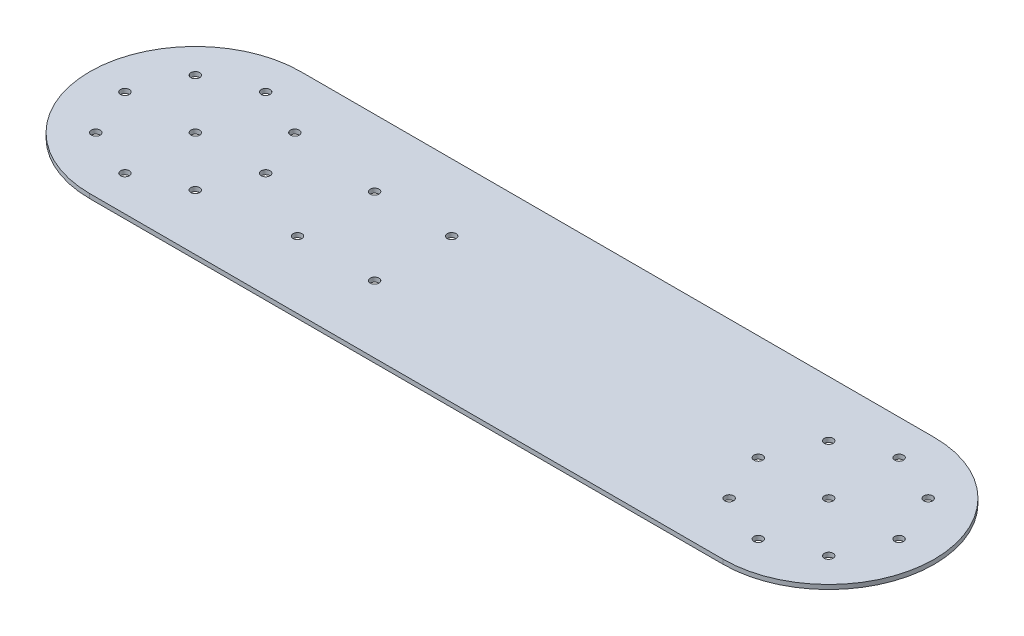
ISO-10303-21;
HEADER;
FILE_DESCRIPTION(('STEP AP214'),'2;1');
FILE_NAME('part.step','',(''),(''),'','','');
FILE_SCHEMA(('AUTOMOTIVE_DESIGN { 1 0 10303 214 1 1 1 1 }'));
ENDSEC;
DATA;
#1=APPLICATION_CONTEXT('core data for automotive mechanical design processes');
#2=APPLICATION_PROTOCOL_DEFINITION('international standard','automotive_design',2000,#1);
#3=PRODUCT_CONTEXT('',#1,'mechanical');
#4=PRODUCT('Part','Part','',(#3));
#5=PRODUCT_RELATED_PRODUCT_CATEGORY('part','',(#4));
#6=PRODUCT_DEFINITION_FORMATION('','',#4);
#7=PRODUCT_DEFINITION_CONTEXT('part definition',#1,'design');
#8=PRODUCT_DEFINITION('design','',#6,#7);
#9=PRODUCT_DEFINITION_SHAPE('','',#8);
#10=(LENGTH_UNIT() NAMED_UNIT(*) SI_UNIT(.MILLI.,.METRE.));
#11=(NAMED_UNIT(*) PLANE_ANGLE_UNIT() SI_UNIT($,.RADIAN.));
#12=(NAMED_UNIT(*) SI_UNIT($,.STERADIAN.) SOLID_ANGLE_UNIT());
#13=UNCERTAINTY_MEASURE_WITH_UNIT(LENGTH_MEASURE(1.E-05),#10,'distance_accuracy_value','');
#14=(GEOMETRIC_REPRESENTATION_CONTEXT(3) GLOBAL_UNCERTAINTY_ASSIGNED_CONTEXT((#13)) GLOBAL_UNIT_ASSIGNED_CONTEXT((#10,
#11,#12)) REPRESENTATION_CONTEXT('',''));
#15=CARTESIAN_POINT('',(0.,0.,0.));
#16=DIRECTION('',(0.,0.,1.));
#17=DIRECTION('',(1.,0.,0.));
#18=AXIS2_PLACEMENT_3D('',#15,#16,#17);
#19=CARTESIAN_POINT('',(228.6,3.175,0.));
#20=DIRECTION('',(0.,-1.,0.));
#21=DIRECTION('',(0.,0.,-1.));
#22=AXIS2_PLACEMENT_3D('',#19,#20,#21);
#23=PLANE('',#22);
#24=CARTESIAN_POINT('',(228.6,3.175,0.));
#25=DIRECTION('',(0.,-1.,0.));
#26=DIRECTION('',(0.,0.,1.));
#27=AXIS2_PLACEMENT_3D('',#24,#25,#26);
#28=CIRCLE('',#27,3.17499999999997);
#29=CARTESIAN_POINT('',(228.6,3.175,3.17499999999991));
#30=VERTEX_POINT('',#29);
#31=EDGE_CURVE('E245',#30,#30,#28,.T.);
#32=ORIENTED_EDGE('',*,*,#31,.T.);
#33=EDGE_LOOP('',(#32));
#34=FACE_BOUND('',#33,.T.);
#35=CARTESIAN_POINT('',(228.6,3.175,-50.8000000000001));
#36=DIRECTION('',(0.,-1.,0.));
#37=DIRECTION('',(0.,0.,1.));
#38=AXIS2_PLACEMENT_3D('',#35,#36,#37);
#39=CIRCLE('',#38,3.17499999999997);
#40=CARTESIAN_POINT('',(228.6,3.175,-47.6250000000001));
#41=VERTEX_POINT('',#40);
#42=EDGE_CURVE('E229',#41,#41,#39,.T.);
#43=ORIENTED_EDGE('',*,*,#42,.T.);
#44=EDGE_LOOP('',(#43));
#45=FACE_BOUND('',#44,.T.);
#46=CARTESIAN_POINT('',(264.521024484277,3.175,-35.9210244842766));
#47=DIRECTION('',(0.,-1.,0.));
#48=DIRECTION('',(-0.707106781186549,0.,0.707106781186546));
#49=AXIS2_PLACEMENT_3D('',#46,#47,#48);
#50=CIRCLE('',#49,3.17499999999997);
#51=CARTESIAN_POINT('',(262.275960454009,3.175,-33.6759604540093));
#52=VERTEX_POINT('',#51);
#53=EDGE_CURVE('E286',#52,#52,#50,.T.);
#54=ORIENTED_EDGE('',*,*,#53,.T.);
#55=EDGE_LOOP('',(#54));
#56=FACE_BOUND('',#55,.T.);
#57=CARTESIAN_POINT('',(279.4,3.175,0.));
#58=DIRECTION('',(0.,-1.,0.));
#59=DIRECTION('',(-1.,0.,0.));
#60=AXIS2_PLACEMENT_3D('',#57,#58,#59);
#61=CIRCLE('',#60,3.17499999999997);
#62=CARTESIAN_POINT('',(276.225,3.175,0.));
#63=VERTEX_POINT('',#62);
#64=EDGE_CURVE('E278',#63,#63,#61,.T.);
#65=ORIENTED_EDGE('',*,*,#64,.T.);
#66=EDGE_LOOP('',(#65));
#67=FACE_BOUND('',#66,.T.);
#68=CARTESIAN_POINT('',(264.521024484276,3.175,35.9210244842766));
#69=DIRECTION('',(0.,-1.,0.));
#70=DIRECTION('',(-0.707106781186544,0.,-0.707106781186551));
#71=AXIS2_PLACEMENT_3D('',#68,#69,#70);
#72=CIRCLE('',#71,3.17499999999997);
#73=CARTESIAN_POINT('',(262.275960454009,3.175,33.6759604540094));
#74=VERTEX_POINT('',#73);
#75=EDGE_CURVE('E270',#74,#74,#72,.T.);
#76=ORIENTED_EDGE('',*,*,#75,.T.);
#77=EDGE_LOOP('',(#76));
#78=FACE_BOUND('',#77,.T.);
#79=CARTESIAN_POINT('',(228.6,3.175,50.7999999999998));
#80=DIRECTION('',(0.,-1.,0.));
#81=DIRECTION('',(0.,0.,-1.));
#82=AXIS2_PLACEMENT_3D('',#79,#80,#81);
#83=CIRCLE('',#82,3.17499999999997);
#84=CARTESIAN_POINT('',(228.6,3.175,47.6249999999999));
#85=VERTEX_POINT('',#84);
#86=EDGE_CURVE('E262',#85,#85,#83,.T.);
#87=ORIENTED_EDGE('',*,*,#86,.T.);
#88=EDGE_LOOP('',(#87));
#89=FACE_BOUND('',#88,.T.);
#90=CARTESIAN_POINT('',(192.678975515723,3.175,35.9210244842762));
#91=DIRECTION('',(0.,-1.,0.));
#92=DIRECTION('',(0.707106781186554,0.,-0.707106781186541));
#93=AXIS2_PLACEMENT_3D('',#90,#91,#92);
#94=CIRCLE('',#93,3.17499999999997);
#95=CARTESIAN_POINT('',(194.92403954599,3.175,33.6759604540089));
#96=VERTEX_POINT('',#95);
#97=EDGE_CURVE('E254',#96,#96,#94,.T.);
#98=ORIENTED_EDGE('',*,*,#97,.T.);
#99=EDGE_LOOP('',(#98));
#100=FACE_BOUND('',#99,.T.);
#101=CARTESIAN_POINT('',(177.8,3.175,-6.10622663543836E-13));
#102=DIRECTION('',(0.,-1.,0.));
#103=DIRECTION('',(1.,0.,0.));
#104=AXIS2_PLACEMENT_3D('',#101,#102,#103);
#105=CIRCLE('',#104,3.17499999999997);
#106=CARTESIAN_POINT('',(180.975,3.175,-5.77311809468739E-13));
#107=VERTEX_POINT('',#106);
#108=EDGE_CURVE('E246',#107,#107,#105,.T.);
#109=ORIENTED_EDGE('',*,*,#108,.T.);
#110=EDGE_LOOP('',(#109));
#111=FACE_BOUND('',#110,.T.);
#112=CARTESIAN_POINT('',(192.678975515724,3.175,-35.9210244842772));
#113=DIRECTION('',(0.,-1.,0.));
#114=DIRECTION('',(0.707106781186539,0.,0.707106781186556));
#115=AXIS2_PLACEMENT_3D('',#112,#113,#114);
#116=CIRCLE('',#115,3.17499999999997);
#117=CARTESIAN_POINT('',(194.924039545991,3.175,-33.6759604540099));
#118=VERTEX_POINT('',#117);
#119=EDGE_CURVE('E236',#118,#118,#116,.T.);
#120=ORIENTED_EDGE('',*,*,#119,.T.);
#121=EDGE_LOOP('',(#120));
#122=FACE_BOUND('',#121,.T.);
#123=CARTESIAN_POINT('',(-279.4,3.175,0.));
#124=DIRECTION('',(0.,1.,0.));
#125=DIRECTION('',(1.,0.,0.));
#126=AXIS2_PLACEMENT_3D('',#123,#124,#125);
#127=CIRCLE('',#126,3.17499999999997);
#128=CARTESIAN_POINT('',(-276.225,3.175,0.));
#129=VERTEX_POINT('',#128);
#130=EDGE_CURVE('E187',#129,#129,#127,.T.);
#131=ORIENTED_EDGE('',*,*,#130,.F.);
#132=EDGE_LOOP('',(#131));
#133=FACE_BOUND('',#132,.T.);
#134=CARTESIAN_POINT('',(-264.521024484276,3.175,35.9210244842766));
#135=DIRECTION('',(0.,1.,0.));
#136=DIRECTION('',(0.707106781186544,0.,-0.707106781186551));
#137=AXIS2_PLACEMENT_3D('',#134,#135,#136);
#138=CIRCLE('',#137,3.17499999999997);
#139=CARTESIAN_POINT('',(-262.275960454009,3.175,33.6759604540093));
#140=VERTEX_POINT('',#139);
#141=EDGE_CURVE('E206',#140,#140,#138,.T.);
#142=ORIENTED_EDGE('',*,*,#141,.F.);
#143=EDGE_LOOP('',(#142));
#144=FACE_BOUND('',#143,.T.);
#145=CARTESIAN_POINT('',(-228.6,3.175,50.7999999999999));
#146=DIRECTION('',(0.,1.,0.));
#147=DIRECTION('',(0.,0.,-1.));
#148=AXIS2_PLACEMENT_3D('',#145,#146,#147);
#149=CIRCLE('',#148,3.17499999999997);
#150=CARTESIAN_POINT('',(-228.6,3.175,47.6249999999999));
#151=VERTEX_POINT('',#150);
#152=EDGE_CURVE('E198',#151,#151,#149,.T.);
#153=ORIENTED_EDGE('',*,*,#152,.F.);
#154=EDGE_LOOP('',(#153));
#155=FACE_BOUND('',#154,.T.);
#156=CARTESIAN_POINT('',(-192.678975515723,3.175,35.9210244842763));
#157=DIRECTION('',(0.,1.,0.));
#158=DIRECTION('',(-0.707106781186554,0.,-0.707106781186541));
#159=AXIS2_PLACEMENT_3D('',#156,#157,#158);
#160=CIRCLE('',#159,3.17499999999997);
#161=CARTESIAN_POINT('',(-194.92403954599,3.175,33.675960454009));
#162=VERTEX_POINT('',#161);
#163=EDGE_CURVE('E188',#162,#162,#160,.T.);
#164=ORIENTED_EDGE('',*,*,#163,.F.);
#165=EDGE_LOOP('',(#164));
#166=FACE_BOUND('',#165,.T.);
#167=CARTESIAN_POINT('',(-177.8,3.175,-7.21644966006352E-13));
#168=DIRECTION('',(0.,1.,0.));
#169=DIRECTION('',(-1.,0.,0.));
#170=AXIS2_PLACEMENT_3D('',#167,#168,#169);
#171=CIRCLE('',#170,3.17499999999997);
#172=CARTESIAN_POINT('',(-180.975,3.175,-6.88334111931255E-13));
#173=VERTEX_POINT('',#172);
#174=EDGE_CURVE('E197',#173,#173,#171,.T.);
#175=ORIENTED_EDGE('',*,*,#174,.F.);
#176=EDGE_LOOP('',(#175));
#177=FACE_BOUND('',#176,.T.);
#178=CARTESIAN_POINT('',(-192.678975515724,3.175,-35.9210244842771));
#179=DIRECTION('',(0.,1.,0.));
#180=DIRECTION('',(-0.707106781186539,0.,0.707106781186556));
#181=AXIS2_PLACEMENT_3D('',#178,#179,#180);
#182=CIRCLE('',#181,3.17499999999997);
#183=CARTESIAN_POINT('',(-194.924039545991,3.175,-33.6759604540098));
#184=VERTEX_POINT('',#183);
#185=EDGE_CURVE('E220',#184,#184,#182,.T.);
#186=ORIENTED_EDGE('',*,*,#185,.F.);
#187=EDGE_LOOP('',(#186));
#188=FACE_BOUND('',#187,.T.);
#189=CARTESIAN_POINT('',(-264.521024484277,3.175,-35.9210244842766));
#190=DIRECTION('',(0.,1.,0.));
#191=DIRECTION('',(0.707106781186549,0.,0.707106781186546));
#192=AXIS2_PLACEMENT_3D('',#189,#190,#191);
#193=CIRCLE('',#192,3.17499999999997);
#194=CARTESIAN_POINT('',(-262.275960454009,3.175,-33.6759604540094));
#195=VERTEX_POINT('',#194);
#196=EDGE_CURVE('E169',#195,#195,#193,.T.);
#197=ORIENTED_EDGE('',*,*,#196,.F.);
#198=EDGE_LOOP('',(#197));
#199=FACE_BOUND('',#198,.T.);
#200=CARTESIAN_POINT('',(-228.6,3.175,-50.8000000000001));
#201=DIRECTION('',(0.,1.,0.));
#202=DIRECTION('',(0.,0.,1.));
#203=AXIS2_PLACEMENT_3D('',#200,#201,#202);
#204=CIRCLE('',#203,3.17499999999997);
#205=CARTESIAN_POINT('',(-228.6,3.175,-47.6250000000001));
#206=VERTEX_POINT('',#205);
#207=EDGE_CURVE('E173',#206,#206,#204,.T.);
#208=ORIENTED_EDGE('',*,*,#207,.F.);
#209=EDGE_LOOP('',(#208));
#210=FACE_BOUND('',#209,.T.);
#211=CARTESIAN_POINT('',(-228.6,3.175,-1.66533453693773E-13));
#212=DIRECTION('',(0.,1.,0.));
#213=DIRECTION('',(0.,0.,1.));
#214=AXIS2_PLACEMENT_3D('',#211,#212,#213);
#215=CIRCLE('',#214,3.17499999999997);
#216=CARTESIAN_POINT('',(-228.6,3.175,3.1749999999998));
#217=VERTEX_POINT('',#216);
#218=EDGE_CURVE('E164',#217,#217,#215,.T.);
#219=ORIENTED_EDGE('',*,*,#218,.F.);
#220=EDGE_LOOP('',(#219));
#221=FACE_BOUND('',#220,.T.);
#222=CARTESIAN_POINT('',(228.6,3.175,0.));
#223=DIRECTION('',(0.,1.,0.));
#224=DIRECTION('',(0.,0.,-1.));
#225=AXIS2_PLACEMENT_3D('',#222,#223,#224);
#226=CIRCLE('',#225,76.2);
#227=CARTESIAN_POINT('',(228.6,3.175,76.1999999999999));
#228=VERTEX_POINT('',#227);
#229=CARTESIAN_POINT('',(228.6,3.175,-76.2000000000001));
#230=VERTEX_POINT('',#229);
#231=EDGE_CURVE('E91',#228,#230,#226,.T.);
#232=ORIENTED_EDGE('',*,*,#231,.T.);
#233=DIRECTION('',(-1.,0.,0.));
#234=VECTOR('',#233,1.);
#235=CARTESIAN_POINT('',(-228.6,3.175,-76.2000000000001));
#236=LINE('',#235,#234);
#237=CARTESIAN_POINT('',(-228.6,3.175,-76.2000000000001));
#238=VERTEX_POINT('',#237);
#239=EDGE_CURVE('E86',#230,#238,#236,.T.);
#240=ORIENTED_EDGE('',*,*,#239,.T.);
#241=CARTESIAN_POINT('',(-228.6,3.175,-1.66533453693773E-13));
#242=DIRECTION('',(0.,1.,0.));
#243=DIRECTION('',(0.,0.,1.));
#244=AXIS2_PLACEMENT_3D('',#241,#242,#243);
#245=CIRCLE('',#244,76.2);
#246=CARTESIAN_POINT('',(-228.6,3.175,76.1999999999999));
#247=VERTEX_POINT('',#246);
#248=EDGE_CURVE('E89',#238,#247,#245,.T.);
#249=ORIENTED_EDGE('',*,*,#248,.T.);
#250=DIRECTION('',(1.,0.,0.));
#251=VECTOR('',#250,1.);
#252=CARTESIAN_POINT('',(-228.6,3.175,76.1999999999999));
#253=LINE('',#252,#251);
#254=EDGE_CURVE('E56',#247,#228,#253,.T.);
#255=ORIENTED_EDGE('',*,*,#254,.T.);
#256=EDGE_LOOP('',(#232,#240,#249,#255));
#257=FACE_BOUND('',#256,.T.);
#258=CARTESIAN_POINT('',(-127.,3.175,-27.8130000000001));
#259=DIRECTION('',(0.,1.,0.));
#260=DIRECTION('',(0.,0.,1.));
#261=AXIS2_PLACEMENT_3D('',#258,#259,#260);
#262=CIRCLE('',#261,3.175);
#263=CARTESIAN_POINT('',(-127.,3.175,-24.6380000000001));
#264=VERTEX_POINT('',#263);
#265=EDGE_CURVE('E112',#264,#264,#262,.T.);
#266=ORIENTED_EDGE('',*,*,#265,.F.);
#267=EDGE_LOOP('',(#266));
#268=FACE_BOUND('',#267,.T.);
#269=CARTESIAN_POINT('',(-127.,3.175,27.8129999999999));
#270=DIRECTION('',(0.,1.,0.));
#271=DIRECTION('',(0.,0.,1.));
#272=AXIS2_PLACEMENT_3D('',#269,#270,#271);
#273=CIRCLE('',#272,3.175);
#274=CARTESIAN_POINT('',(-127.,3.175,30.9879999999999));
#275=VERTEX_POINT('',#274);
#276=EDGE_CURVE('E136',#275,#275,#273,.T.);
#277=ORIENTED_EDGE('',*,*,#276,.F.);
#278=EDGE_LOOP('',(#277));
#279=FACE_BOUND('',#278,.T.);
#280=CARTESIAN_POINT('',(-71.3739999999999,3.175,27.8129999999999));
#281=DIRECTION('',(0.,1.,0.));
#282=DIRECTION('',(0.,0.,-1.));
#283=AXIS2_PLACEMENT_3D('',#280,#281,#282);
#284=CIRCLE('',#283,3.175);
#285=CARTESIAN_POINT('',(-71.3739999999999,3.175,24.6379999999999));
#286=VERTEX_POINT('',#285);
#287=EDGE_CURVE('E144',#286,#286,#284,.T.);
#288=ORIENTED_EDGE('',*,*,#287,.F.);
#289=EDGE_LOOP('',(#288));
#290=FACE_BOUND('',#289,.T.);
#291=CARTESIAN_POINT('',(-71.3740000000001,3.175,-27.8130000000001));
#292=DIRECTION('',(0.,1.,0.));
#293=DIRECTION('',(0.,0.,-1.));
#294=AXIS2_PLACEMENT_3D('',#291,#292,#293);
#295=CIRCLE('',#294,3.175);
#296=CARTESIAN_POINT('',(-71.3740000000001,3.175,-30.9880000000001));
#297=VERTEX_POINT('',#296);
#298=EDGE_CURVE('E152',#297,#297,#295,.T.);
#299=ORIENTED_EDGE('',*,*,#298,.F.);
#300=EDGE_LOOP('',(#299));
#301=FACE_BOUND('',#300,.T.);
#302=ADVANCED_FACE('F38',(#34,#45,#56,#67,#78,#89,#100,#111,#122,#133,#144,#155,#166,#177,#188,
#199,#210,#221,#257,#268,#279,#290,#301),#23,.F.);
#303=CARTESIAN_POINT('',(228.6,0.,0.));
#304=DIRECTION('',(0.,-1.,0.));
#305=DIRECTION('',(0.,0.,-1.));
#306=AXIS2_PLACEMENT_3D('',#303,#304,#305);
#307=PLANE('',#306);
#308=CARTESIAN_POINT('',(228.6,0.,0.));
#309=DIRECTION('',(0.,-1.,0.));
#310=DIRECTION('',(0.,0.,1.));
#311=AXIS2_PLACEMENT_3D('',#308,#309,#310);
#312=CIRCLE('',#311,3.17499999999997);
#313=CARTESIAN_POINT('',(228.6,0.,3.17499999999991));
#314=VERTEX_POINT('',#313);
#315=EDGE_CURVE('E303',#314,#314,#312,.T.);
#316=ORIENTED_EDGE('',*,*,#315,.F.);
#317=EDGE_LOOP('',(#316));
#318=FACE_BOUND('',#317,.T.);
#319=CARTESIAN_POINT('',(228.6,0.,-50.8000000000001));
#320=DIRECTION('',(0.,-1.,0.));
#321=DIRECTION('',(0.,0.,1.));
#322=AXIS2_PLACEMENT_3D('',#319,#320,#321);
#323=CIRCLE('',#322,3.17499999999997);
#324=CARTESIAN_POINT('',(228.6,0.,-47.6250000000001));
#325=VERTEX_POINT('',#324);
#326=EDGE_CURVE('E290',#325,#325,#323,.T.);
#327=ORIENTED_EDGE('',*,*,#326,.F.);
#328=EDGE_LOOP('',(#327));
#329=FACE_BOUND('',#328,.T.);
#330=CARTESIAN_POINT('',(264.521024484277,0.,-35.9210244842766));
#331=DIRECTION('',(0.,-1.,0.));
#332=DIRECTION('',(-0.707106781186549,0.,0.707106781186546));
#333=AXIS2_PLACEMENT_3D('',#330,#331,#332);
#334=CIRCLE('',#333,3.17499999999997);
#335=CARTESIAN_POINT('',(262.275960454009,0.,-33.6759604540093));
#336=VERTEX_POINT('',#335);
#337=EDGE_CURVE('E282',#336,#336,#334,.T.);
#338=ORIENTED_EDGE('',*,*,#337,.F.);
#339=EDGE_LOOP('',(#338));
#340=FACE_BOUND('',#339,.T.);
#341=CARTESIAN_POINT('',(279.4,0.,0.));
#342=DIRECTION('',(0.,-1.,0.));
#343=DIRECTION('',(-1.,0.,0.));
#344=AXIS2_PLACEMENT_3D('',#341,#342,#343);
#345=CIRCLE('',#344,3.17499999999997);
#346=CARTESIAN_POINT('',(276.225,0.,0.));
#347=VERTEX_POINT('',#346);
#348=EDGE_CURVE('E274',#347,#347,#345,.T.);
#349=ORIENTED_EDGE('',*,*,#348,.F.);
#350=EDGE_LOOP('',(#349));
#351=FACE_BOUND('',#350,.T.);
#352=CARTESIAN_POINT('',(264.521024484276,0.,35.9210244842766));
#353=DIRECTION('',(0.,-1.,0.));
#354=DIRECTION('',(-0.707106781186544,0.,-0.707106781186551));
#355=AXIS2_PLACEMENT_3D('',#352,#353,#354);
#356=CIRCLE('',#355,3.17499999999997);
#357=CARTESIAN_POINT('',(262.275960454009,0.,33.6759604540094));
#358=VERTEX_POINT('',#357);
#359=EDGE_CURVE('E266',#358,#358,#356,.T.);
#360=ORIENTED_EDGE('',*,*,#359,.F.);
#361=EDGE_LOOP('',(#360));
#362=FACE_BOUND('',#361,.T.);
#363=CARTESIAN_POINT('',(228.6,0.,50.7999999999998));
#364=DIRECTION('',(0.,-1.,0.));
#365=DIRECTION('',(0.,0.,-1.));
#366=AXIS2_PLACEMENT_3D('',#363,#364,#365);
#367=CIRCLE('',#366,3.17499999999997);
#368=CARTESIAN_POINT('',(228.6,0.,47.6249999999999));
#369=VERTEX_POINT('',#368);
#370=EDGE_CURVE('E258',#369,#369,#367,.T.);
#371=ORIENTED_EDGE('',*,*,#370,.F.);
#372=EDGE_LOOP('',(#371));
#373=FACE_BOUND('',#372,.T.);
#374=CARTESIAN_POINT('',(192.678975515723,0.,35.9210244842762));
#375=DIRECTION('',(0.,-1.,0.));
#376=DIRECTION('',(0.707106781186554,0.,-0.707106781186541));
#377=AXIS2_PLACEMENT_3D('',#374,#375,#376);
#378=CIRCLE('',#377,3.17499999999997);
#379=CARTESIAN_POINT('',(194.92403954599,0.,33.6759604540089));
#380=VERTEX_POINT('',#379);
#381=EDGE_CURVE('E250',#380,#380,#378,.T.);
#382=ORIENTED_EDGE('',*,*,#381,.F.);
#383=EDGE_LOOP('',(#382));
#384=FACE_BOUND('',#383,.T.);
#385=CARTESIAN_POINT('',(177.8,0.,-6.10622663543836E-13));
#386=DIRECTION('',(0.,-1.,0.));
#387=DIRECTION('',(1.,0.,0.));
#388=AXIS2_PLACEMENT_3D('',#385,#386,#387);
#389=CIRCLE('',#388,3.17499999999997);
#390=CARTESIAN_POINT('',(180.975,0.,-5.77311809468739E-13));
#391=VERTEX_POINT('',#390);
#392=EDGE_CURVE('E240',#391,#391,#389,.T.);
#393=ORIENTED_EDGE('',*,*,#392,.F.);
#394=EDGE_LOOP('',(#393));
#395=FACE_BOUND('',#394,.T.);
#396=CARTESIAN_POINT('',(192.678975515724,0.,-35.9210244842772));
#397=DIRECTION('',(0.,-1.,0.));
#398=DIRECTION('',(0.707106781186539,0.,0.707106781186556));
#399=AXIS2_PLACEMENT_3D('',#396,#397,#398);
#400=CIRCLE('',#399,3.17499999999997);
#401=CARTESIAN_POINT('',(194.924039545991,0.,-33.6759604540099));
#402=VERTEX_POINT('',#401);
#403=EDGE_CURVE('E241',#402,#402,#400,.T.);
#404=ORIENTED_EDGE('',*,*,#403,.F.);
#405=EDGE_LOOP('',(#404));
#406=FACE_BOUND('',#405,.T.);
#407=CARTESIAN_POINT('',(-279.4,0.,0.));
#408=DIRECTION('',(0.,1.,0.));
#409=DIRECTION('',(1.,0.,0.));
#410=AXIS2_PLACEMENT_3D('',#407,#408,#409);
#411=CIRCLE('',#410,3.17499999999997);
#412=CARTESIAN_POINT('',(-276.225,0.,0.));
#413=VERTEX_POINT('',#412);
#414=EDGE_CURVE('E210',#413,#413,#411,.T.);
#415=ORIENTED_EDGE('',*,*,#414,.T.);
#416=EDGE_LOOP('',(#415));
#417=FACE_BOUND('',#416,.T.);
#418=CARTESIAN_POINT('',(-264.521024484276,0.,35.9210244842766));
#419=DIRECTION('',(0.,1.,0.));
#420=DIRECTION('',(0.707106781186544,0.,-0.707106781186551));
#421=AXIS2_PLACEMENT_3D('',#418,#419,#420);
#422=CIRCLE('',#421,3.17499999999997);
#423=CARTESIAN_POINT('',(-262.275960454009,0.,33.6759604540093));
#424=VERTEX_POINT('',#423);
#425=EDGE_CURVE('E202',#424,#424,#422,.T.);
#426=ORIENTED_EDGE('',*,*,#425,.T.);
#427=EDGE_LOOP('',(#426));
#428=FACE_BOUND('',#427,.T.);
#429=CARTESIAN_POINT('',(-228.6,0.,50.7999999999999));
#430=DIRECTION('',(0.,1.,0.));
#431=DIRECTION('',(0.,0.,-1.));
#432=AXIS2_PLACEMENT_3D('',#429,#430,#431);
#433=CIRCLE('',#432,3.17499999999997);
#434=CARTESIAN_POINT('',(-228.6,0.,47.6249999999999));
#435=VERTEX_POINT('',#434);
#436=EDGE_CURVE('E192',#435,#435,#433,.T.);
#437=ORIENTED_EDGE('',*,*,#436,.T.);
#438=EDGE_LOOP('',(#437));
#439=FACE_BOUND('',#438,.T.);
#440=CARTESIAN_POINT('',(-192.678975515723,0.,35.9210244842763));
#441=DIRECTION('',(0.,1.,0.));
#442=DIRECTION('',(-0.707106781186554,0.,-0.707106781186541));
#443=AXIS2_PLACEMENT_3D('',#440,#441,#442);
#444=CIRCLE('',#443,3.17499999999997);
#445=CARTESIAN_POINT('',(-194.92403954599,0.,33.675960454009));
#446=VERTEX_POINT('',#445);
#447=EDGE_CURVE('E193',#446,#446,#444,.T.);
#448=ORIENTED_EDGE('',*,*,#447,.T.);
#449=EDGE_LOOP('',(#448));
#450=FACE_BOUND('',#449,.T.);
#451=CARTESIAN_POINT('',(-177.8,0.,-7.21644966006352E-13));
#452=DIRECTION('',(0.,1.,0.));
#453=DIRECTION('',(-1.,0.,0.));
#454=AXIS2_PLACEMENT_3D('',#451,#452,#453);
#455=CIRCLE('',#454,3.17499999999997);
#456=CARTESIAN_POINT('',(-180.975,0.,-6.88334111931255E-13));
#457=VERTEX_POINT('',#456);
#458=EDGE_CURVE('E224',#457,#457,#455,.T.);
#459=ORIENTED_EDGE('',*,*,#458,.T.);
#460=EDGE_LOOP('',(#459));
#461=FACE_BOUND('',#460,.T.);
#462=CARTESIAN_POINT('',(-192.678975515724,0.,-35.9210244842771));
#463=DIRECTION('',(0.,1.,0.));
#464=DIRECTION('',(-0.707106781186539,0.,0.707106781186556));
#465=AXIS2_PLACEMENT_3D('',#462,#463,#464);
#466=CIRCLE('',#465,3.17499999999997);
#467=CARTESIAN_POINT('',(-194.924039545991,0.,-33.6759604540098));
#468=VERTEX_POINT('',#467);
#469=EDGE_CURVE('E225',#468,#468,#466,.T.);
#470=ORIENTED_EDGE('',*,*,#469,.T.);
#471=EDGE_LOOP('',(#470));
#472=FACE_BOUND('',#471,.T.);
#473=CARTESIAN_POINT('',(-264.521024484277,0.,-35.9210244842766));
#474=DIRECTION('',(0.,1.,0.));
#475=DIRECTION('',(0.707106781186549,0.,0.707106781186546));
#476=AXIS2_PLACEMENT_3D('',#473,#474,#475);
#477=CIRCLE('',#476,3.17499999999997);
#478=CARTESIAN_POINT('',(-262.275960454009,0.,-33.6759604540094));
#479=VERTEX_POINT('',#478);
#480=EDGE_CURVE('E183',#479,#479,#477,.T.);
#481=ORIENTED_EDGE('',*,*,#480,.T.);
#482=EDGE_LOOP('',(#481));
#483=FACE_BOUND('',#482,.T.);
#484=CARTESIAN_POINT('',(-228.6,0.,-50.8000000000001));
#485=DIRECTION('',(0.,1.,0.));
#486=DIRECTION('',(0.,0.,1.));
#487=AXIS2_PLACEMENT_3D('',#484,#485,#486);
#488=CIRCLE('',#487,3.17499999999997);
#489=CARTESIAN_POINT('',(-228.6,0.,-47.6250000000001));
#490=VERTEX_POINT('',#489);
#491=EDGE_CURVE('E160',#490,#490,#488,.T.);
#492=ORIENTED_EDGE('',*,*,#491,.T.);
#493=EDGE_LOOP('',(#492));
#494=FACE_BOUND('',#493,.T.);
#495=CARTESIAN_POINT('',(-228.6,0.,-1.66533453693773E-13));
#496=DIRECTION('',(0.,1.,0.));
#497=DIRECTION('',(0.,0.,1.));
#498=AXIS2_PLACEMENT_3D('',#495,#496,#497);
#499=CIRCLE('',#498,3.17499999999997);
#500=CARTESIAN_POINT('',(-228.6,0.,3.1749999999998));
#501=VERTEX_POINT('',#500);
#502=EDGE_CURVE('E168',#501,#501,#499,.T.);
#503=ORIENTED_EDGE('',*,*,#502,.T.);
#504=EDGE_LOOP('',(#503));
#505=FACE_BOUND('',#504,.T.);
#506=CARTESIAN_POINT('',(-71.3739999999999,0.,27.8129999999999));
#507=DIRECTION('',(0.,1.,0.));
#508=DIRECTION('',(0.,0.,-1.));
#509=AXIS2_PLACEMENT_3D('',#506,#507,#508);
#510=CIRCLE('',#509,3.175);
#511=CARTESIAN_POINT('',(-71.3739999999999,0.,24.6379999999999));
#512=VERTEX_POINT('',#511);
#513=EDGE_CURVE('E148',#512,#512,#510,.T.);
#514=ORIENTED_EDGE('',*,*,#513,.T.);
#515=EDGE_LOOP('',(#514));
#516=FACE_BOUND('',#515,.T.);
#517=CARTESIAN_POINT('',(-127.,0.,-27.8130000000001));
#518=DIRECTION('',(0.,1.,0.));
#519=DIRECTION('',(0.,0.,1.));
#520=AXIS2_PLACEMENT_3D('',#517,#518,#519);
#521=CIRCLE('',#520,3.175);
#522=CARTESIAN_POINT('',(-127.,0.,-24.6380000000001));
#523=VERTEX_POINT('',#522);
#524=EDGE_CURVE('E132',#523,#523,#521,.T.);
#525=ORIENTED_EDGE('',*,*,#524,.T.);
#526=EDGE_LOOP('',(#525));
#527=FACE_BOUND('',#526,.T.);
#528=CARTESIAN_POINT('',(228.6,0.,0.));
#529=DIRECTION('',(0.,1.,0.));
#530=DIRECTION('',(0.,0.,-1.));
#531=AXIS2_PLACEMENT_3D('',#528,#529,#530);
#532=CIRCLE('',#531,76.2);
#533=CARTESIAN_POINT('',(228.6,0.,76.1999999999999));
#534=VERTEX_POINT('',#533);
#535=CARTESIAN_POINT('',(228.6,0.,-76.2000000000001));
#536=VERTEX_POINT('',#535);
#537=EDGE_CURVE('E108',#534,#536,#532,.T.);
#538=ORIENTED_EDGE('',*,*,#537,.F.);
#539=DIRECTION('',(1.,0.,0.));
#540=VECTOR('',#539,1.);
#541=CARTESIAN_POINT('',(-228.6,0.,76.1999999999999));
#542=LINE('',#541,#540);
#543=CARTESIAN_POINT('',(-228.6,0.,76.1999999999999));
#544=VERTEX_POINT('',#543);
#545=EDGE_CURVE('E79',#544,#534,#542,.T.);
#546=ORIENTED_EDGE('',*,*,#545,.F.);
#547=CARTESIAN_POINT('',(-228.6,0.,-1.66533453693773E-13));
#548=DIRECTION('',(0.,1.,0.));
#549=DIRECTION('',(0.,0.,1.));
#550=AXIS2_PLACEMENT_3D('',#547,#548,#549);
#551=CIRCLE('',#550,76.2);
#552=CARTESIAN_POINT('',(-228.6,0.,-76.2000000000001));
#553=VERTEX_POINT('',#552);
#554=EDGE_CURVE('E73',#553,#544,#551,.T.);
#555=ORIENTED_EDGE('',*,*,#554,.F.);
#556=DIRECTION('',(-1.,0.,0.));
#557=VECTOR('',#556,1.);
#558=CARTESIAN_POINT('',(-228.6,0.,-76.2000000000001));
#559=LINE('',#558,#557);
#560=EDGE_CURVE('E96',#536,#553,#559,.T.);
#561=ORIENTED_EDGE('',*,*,#560,.F.);
#562=EDGE_LOOP('',(#538,#546,#555,#561));
#563=FACE_BOUND('',#562,.T.);
#564=CARTESIAN_POINT('',(-127.,0.,27.8129999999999));
#565=DIRECTION('',(0.,1.,0.));
#566=DIRECTION('',(0.,0.,1.));
#567=AXIS2_PLACEMENT_3D('',#564,#565,#566);
#568=CIRCLE('',#567,3.175);
#569=CARTESIAN_POINT('',(-127.,0.,30.9879999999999));
#570=VERTEX_POINT('',#569);
#571=EDGE_CURVE('E140',#570,#570,#568,.T.);
#572=ORIENTED_EDGE('',*,*,#571,.T.);
#573=EDGE_LOOP('',(#572));
#574=FACE_BOUND('',#573,.T.);
#575=CARTESIAN_POINT('',(-71.3740000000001,0.,-27.8130000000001));
#576=DIRECTION('',(0.,1.,0.));
#577=DIRECTION('',(0.,0.,-1.));
#578=AXIS2_PLACEMENT_3D('',#575,#576,#577);
#579=CIRCLE('',#578,3.175);
#580=CARTESIAN_POINT('',(-71.3740000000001,0.,-30.9880000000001));
#581=VERTEX_POINT('',#580);
#582=EDGE_CURVE('E156',#581,#581,#579,.T.);
#583=ORIENTED_EDGE('',*,*,#582,.T.);
#584=EDGE_LOOP('',(#583));
#585=FACE_BOUND('',#584,.T.);
#586=ADVANCED_FACE('F126',(#318,#329,#340,#351,#362,#373,#384,#395,#406,#417,#428,#439,#450,
#461,#472,#483,#494,#505,#516,#527,#563,#574,#585),#307,.T.);
#587=CARTESIAN_POINT('',(228.6,3.175,0.));
#588=DIRECTION('',(0.,-1.,0.));
#589=DIRECTION('',(0.,0.,-1.));
#590=AXIS2_PLACEMENT_3D('',#587,#588,#589);
#591=CYLINDRICAL_SURFACE('',#590,76.2);
#592=ORIENTED_EDGE('',*,*,#537,.T.);
#593=DIRECTION('',(0.,-1.,0.));
#594=VECTOR('',#593,1.);
#595=CARTESIAN_POINT('',(228.6,3.175,-76.2000000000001));
#596=LINE('',#595,#594);
#597=EDGE_CURVE('E11',#230,#536,#596,.T.);
#598=ORIENTED_EDGE('',*,*,#597,.F.);
#599=ORIENTED_EDGE('',*,*,#231,.F.);
#600=DIRECTION('',(0.,-1.,0.));
#601=VECTOR('',#600,1.);
#602=CARTESIAN_POINT('',(228.6,3.175,76.1999999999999));
#603=LINE('',#602,#601);
#604=EDGE_CURVE('E104',#228,#534,#603,.T.);
#605=ORIENTED_EDGE('',*,*,#604,.T.);
#606=EDGE_LOOP('',(#592,#598,#599,#605));
#607=FACE_BOUND('',#606,.T.);
#608=ADVANCED_FACE('F40',(#607),#591,.T.);
#609=CARTESIAN_POINT('',(-228.6,3.175,-76.2000000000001));
#610=DIRECTION('',(0.,0.,1.));
#611=DIRECTION('',(1.,0.,0.));
#612=AXIS2_PLACEMENT_3D('',#609,#610,#611);
#613=PLANE('',#612);
#614=ORIENTED_EDGE('',*,*,#560,.T.);
#615=DIRECTION('',(0.,-1.,0.));
#616=VECTOR('',#615,1.);
#617=CARTESIAN_POINT('',(-228.6,3.175,-76.2000000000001));
#618=LINE('',#617,#616);
#619=EDGE_CURVE('E48',#238,#553,#618,.T.);
#620=ORIENTED_EDGE('',*,*,#619,.F.);
#621=ORIENTED_EDGE('',*,*,#239,.F.);
#622=ORIENTED_EDGE('',*,*,#597,.T.);
#623=EDGE_LOOP('',(#614,#620,#621,#622));
#624=FACE_BOUND('',#623,.T.);
#625=ADVANCED_FACE('F95',(#624),#613,.F.);
#626=CARTESIAN_POINT('',(-228.6,3.175,-1.66533453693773E-13));
#627=DIRECTION('',(0.,-1.,0.));
#628=DIRECTION('',(0.,0.,-1.));
#629=AXIS2_PLACEMENT_3D('',#626,#627,#628);
#630=CYLINDRICAL_SURFACE('',#629,76.2);
#631=ORIENTED_EDGE('',*,*,#554,.T.);
#632=DIRECTION('',(0.,-1.,0.));
#633=VECTOR('',#632,1.);
#634=CARTESIAN_POINT('',(-228.6,3.175,76.1999999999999));
#635=LINE('',#634,#633);
#636=EDGE_CURVE('E98',#247,#544,#635,.T.);
#637=ORIENTED_EDGE('',*,*,#636,.F.);
#638=ORIENTED_EDGE('',*,*,#248,.F.);
#639=ORIENTED_EDGE('',*,*,#619,.T.);
#640=EDGE_LOOP('',(#631,#637,#638,#639));
#641=FACE_BOUND('',#640,.T.);
#642=ADVANCED_FACE('F99',(#641),#630,.T.);
#643=CARTESIAN_POINT('',(-228.6,3.175,76.1999999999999));
#644=DIRECTION('',(0.,0.,-1.));
#645=DIRECTION('',(-1.,0.,0.));
#646=AXIS2_PLACEMENT_3D('',#643,#644,#645);
#647=PLANE('',#646);
#648=ORIENTED_EDGE('',*,*,#545,.T.);
#649=ORIENTED_EDGE('',*,*,#604,.F.);
#650=ORIENTED_EDGE('',*,*,#254,.F.);
#651=ORIENTED_EDGE('',*,*,#636,.T.);
#652=EDGE_LOOP('',(#648,#649,#650,#651));
#653=FACE_BOUND('',#652,.T.);
#654=ADVANCED_FACE('F123',(#653),#647,.F.);
#655=CARTESIAN_POINT('',(-127.,3.175,-27.8130000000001));
#656=DIRECTION('',(0.,-1.,0.));
#657=DIRECTION('',(0.,0.,-1.));
#658=AXIS2_PLACEMENT_3D('',#655,#656,#657);
#659=CYLINDRICAL_SURFACE('',#658,3.175);
#660=ORIENTED_EDGE('',*,*,#265,.T.);
#661=EDGE_LOOP('',(#660));
#662=FACE_BOUND('',#661,.T.);
#663=ORIENTED_EDGE('',*,*,#524,.F.);
#664=EDGE_LOOP('',(#663));
#665=FACE_BOUND('',#664,.T.);
#666=ADVANCED_FACE('F353',(#662,#665),#659,.F.);
#667=CARTESIAN_POINT('',(-127.,3.175,27.8129999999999));
#668=DIRECTION('',(0.,-1.,0.));
#669=DIRECTION('',(0.,0.,-1.));
#670=AXIS2_PLACEMENT_3D('',#667,#668,#669);
#671=CYLINDRICAL_SURFACE('',#670,3.175);
#672=ORIENTED_EDGE('',*,*,#276,.T.);
#673=EDGE_LOOP('',(#672));
#674=FACE_BOUND('',#673,.T.);
#675=ORIENTED_EDGE('',*,*,#571,.F.);
#676=EDGE_LOOP('',(#675));
#677=FACE_BOUND('',#676,.T.);
#678=ADVANCED_FACE('F355',(#674,#677),#671,.F.);
#679=CARTESIAN_POINT('',(-71.3739999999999,3.175,27.8129999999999));
#680=DIRECTION('',(0.,-1.,0.));
#681=DIRECTION('',(0.,0.,-1.));
#682=AXIS2_PLACEMENT_3D('',#679,#680,#681);
#683=CYLINDRICAL_SURFACE('',#682,3.175);
#684=ORIENTED_EDGE('',*,*,#287,.T.);
#685=EDGE_LOOP('',(#684));
#686=FACE_BOUND('',#685,.T.);
#687=ORIENTED_EDGE('',*,*,#513,.F.);
#688=EDGE_LOOP('',(#687));
#689=FACE_BOUND('',#688,.T.);
#690=ADVANCED_FACE('F362',(#686,#689),#683,.F.);
#691=CARTESIAN_POINT('',(-71.3740000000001,3.175,-27.8130000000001));
#692=DIRECTION('',(0.,-1.,0.));
#693=DIRECTION('',(0.,0.,-1.));
#694=AXIS2_PLACEMENT_3D('',#691,#692,#693);
#695=CYLINDRICAL_SURFACE('',#694,3.175);
#696=ORIENTED_EDGE('',*,*,#298,.T.);
#697=EDGE_LOOP('',(#696));
#698=FACE_BOUND('',#697,.T.);
#699=ORIENTED_EDGE('',*,*,#582,.F.);
#700=EDGE_LOOP('',(#699));
#701=FACE_BOUND('',#700,.T.);
#702=ADVANCED_FACE('F423',(#698,#701),#695,.F.);
#703=CARTESIAN_POINT('',(-228.6,0.,-1.66533453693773E-13));
#704=DIRECTION('',(0.,1.,0.));
#705=DIRECTION('',(0.,0.,1.));
#706=AXIS2_PLACEMENT_3D('',#703,#704,#705);
#707=CYLINDRICAL_SURFACE('',#706,3.17499999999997);
#708=ORIENTED_EDGE('',*,*,#502,.F.);
#709=EDGE_LOOP('',(#708));
#710=FACE_BOUND('',#709,.T.);
#711=ORIENTED_EDGE('',*,*,#218,.T.);
#712=EDGE_LOOP('',(#711));
#713=FACE_BOUND('',#712,.T.);
#714=ADVANCED_FACE('F432',(#710,#713),#707,.F.);
#715=CARTESIAN_POINT('',(-228.6,0.,-50.8000000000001));
#716=DIRECTION('',(0.,1.,0.));
#717=DIRECTION('',(0.,0.,1.));
#718=AXIS2_PLACEMENT_3D('',#715,#716,#717);
#719=CYLINDRICAL_SURFACE('',#718,3.17499999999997);
#720=ORIENTED_EDGE('',*,*,#491,.F.);
#721=EDGE_LOOP('',(#720));
#722=FACE_BOUND('',#721,.T.);
#723=ORIENTED_EDGE('',*,*,#207,.T.);
#724=EDGE_LOOP('',(#723));
#725=FACE_BOUND('',#724,.T.);
#726=ADVANCED_FACE('F441',(#722,#725),#719,.F.);
#727=CARTESIAN_POINT('',(-264.521024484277,0.,-35.9210244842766));
#728=DIRECTION('',(0.,1.,0.));
#729=DIRECTION('',(0.707106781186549,0.,0.707106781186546));
#730=AXIS2_PLACEMENT_3D('',#727,#728,#729);
#731=CYLINDRICAL_SURFACE('',#730,3.17499999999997);
#732=ORIENTED_EDGE('',*,*,#480,.F.);
#733=EDGE_LOOP('',(#732));
#734=FACE_BOUND('',#733,.T.);
#735=ORIENTED_EDGE('',*,*,#196,.T.);
#736=EDGE_LOOP('',(#735));
#737=FACE_BOUND('',#736,.T.);
#738=ADVANCED_FACE('F450',(#734,#737),#731,.F.);
#739=CARTESIAN_POINT('',(-192.678975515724,0.,-35.9210244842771));
#740=DIRECTION('',(0.,1.,0.));
#741=DIRECTION('',(-0.707106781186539,0.,0.707106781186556));
#742=AXIS2_PLACEMENT_3D('',#739,#740,#741);
#743=CYLINDRICAL_SURFACE('',#742,3.17499999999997);
#744=ORIENTED_EDGE('',*,*,#469,.F.);
#745=EDGE_LOOP('',(#744));
#746=FACE_BOUND('',#745,.T.);
#747=ORIENTED_EDGE('',*,*,#185,.T.);
#748=EDGE_LOOP('',(#747));
#749=FACE_BOUND('',#748,.T.);
#750=ADVANCED_FACE('F459',(#746,#749),#743,.F.);
#751=CARTESIAN_POINT('',(-177.8,0.,-7.21644966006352E-13));
#752=DIRECTION('',(0.,1.,0.));
#753=DIRECTION('',(-1.,0.,0.));
#754=AXIS2_PLACEMENT_3D('',#751,#752,#753);
#755=CYLINDRICAL_SURFACE('',#754,3.17499999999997);
#756=ORIENTED_EDGE('',*,*,#458,.F.);
#757=EDGE_LOOP('',(#756));
#758=FACE_BOUND('',#757,.T.);
#759=ORIENTED_EDGE('',*,*,#174,.T.);
#760=EDGE_LOOP('',(#759));
#761=FACE_BOUND('',#760,.T.);
#762=ADVANCED_FACE('F468',(#758,#761),#755,.F.);
#763=CARTESIAN_POINT('',(-192.678975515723,0.,35.9210244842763));
#764=DIRECTION('',(0.,1.,0.));
#765=DIRECTION('',(-0.707106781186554,0.,-0.707106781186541));
#766=AXIS2_PLACEMENT_3D('',#763,#764,#765);
#767=CYLINDRICAL_SURFACE('',#766,3.17499999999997);
#768=ORIENTED_EDGE('',*,*,#447,.F.);
#769=EDGE_LOOP('',(#768));
#770=FACE_BOUND('',#769,.T.);
#771=ORIENTED_EDGE('',*,*,#163,.T.);
#772=EDGE_LOOP('',(#771));
#773=FACE_BOUND('',#772,.T.);
#774=ADVANCED_FACE('F477',(#770,#773),#767,.F.);
#775=CARTESIAN_POINT('',(-228.6,0.,50.7999999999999));
#776=DIRECTION('',(0.,1.,0.));
#777=DIRECTION('',(0.,0.,-1.));
#778=AXIS2_PLACEMENT_3D('',#775,#776,#777);
#779=CYLINDRICAL_SURFACE('',#778,3.17499999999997);
#780=ORIENTED_EDGE('',*,*,#436,.F.);
#781=EDGE_LOOP('',(#780));
#782=FACE_BOUND('',#781,.T.);
#783=ORIENTED_EDGE('',*,*,#152,.T.);
#784=EDGE_LOOP('',(#783));
#785=FACE_BOUND('',#784,.T.);
#786=ADVANCED_FACE('F486',(#782,#785),#779,.F.);
#787=CARTESIAN_POINT('',(-264.521024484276,0.,35.9210244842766));
#788=DIRECTION('',(0.,1.,0.));
#789=DIRECTION('',(0.707106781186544,0.,-0.707106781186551));
#790=AXIS2_PLACEMENT_3D('',#787,#788,#789);
#791=CYLINDRICAL_SURFACE('',#790,3.17499999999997);
#792=ORIENTED_EDGE('',*,*,#425,.F.);
#793=EDGE_LOOP('',(#792));
#794=FACE_BOUND('',#793,.T.);
#795=ORIENTED_EDGE('',*,*,#141,.T.);
#796=EDGE_LOOP('',(#795));
#797=FACE_BOUND('',#796,.T.);
#798=ADVANCED_FACE('F495',(#794,#797),#791,.F.);
#799=CARTESIAN_POINT('',(-279.4,0.,0.));
#800=DIRECTION('',(0.,1.,0.));
#801=DIRECTION('',(1.,0.,0.));
#802=AXIS2_PLACEMENT_3D('',#799,#800,#801);
#803=CYLINDRICAL_SURFACE('',#802,3.17499999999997);
#804=ORIENTED_EDGE('',*,*,#414,.F.);
#805=EDGE_LOOP('',(#804));
#806=FACE_BOUND('',#805,.T.);
#807=ORIENTED_EDGE('',*,*,#130,.T.);
#808=EDGE_LOOP('',(#807));
#809=FACE_BOUND('',#808,.T.);
#810=ADVANCED_FACE('F504',(#806,#809),#803,.F.);
#811=CARTESIAN_POINT('',(192.678975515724,0.,-35.9210244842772));
#812=DIRECTION('',(0.,1.,0.));
#813=DIRECTION('',(0.707106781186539,0.,0.707106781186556));
#814=AXIS2_PLACEMENT_3D('',#811,#812,#813);
#815=CYLINDRICAL_SURFACE('',#814,3.17499999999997);
#816=ORIENTED_EDGE('',*,*,#403,.T.);
#817=EDGE_LOOP('',(#816));
#818=FACE_BOUND('',#817,.T.);
#819=ORIENTED_EDGE('',*,*,#119,.F.);
#820=EDGE_LOOP('',(#819));
#821=FACE_BOUND('',#820,.T.);
#822=ADVANCED_FACE('F513',(#818,#821),#815,.F.);
#823=CARTESIAN_POINT('',(177.8,0.,-6.10622663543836E-13));
#824=DIRECTION('',(0.,1.,0.));
#825=DIRECTION('',(1.,0.,0.));
#826=AXIS2_PLACEMENT_3D('',#823,#824,#825);
#827=CYLINDRICAL_SURFACE('',#826,3.17499999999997);
#828=ORIENTED_EDGE('',*,*,#392,.T.);
#829=EDGE_LOOP('',(#828));
#830=FACE_BOUND('',#829,.T.);
#831=ORIENTED_EDGE('',*,*,#108,.F.);
#832=EDGE_LOOP('',(#831));
#833=FACE_BOUND('',#832,.T.);
#834=ADVANCED_FACE('F522',(#830,#833),#827,.F.);
#835=CARTESIAN_POINT('',(192.678975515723,0.,35.9210244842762));
#836=DIRECTION('',(0.,1.,0.));
#837=DIRECTION('',(0.707106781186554,0.,-0.707106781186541));
#838=AXIS2_PLACEMENT_3D('',#835,#836,#837);
#839=CYLINDRICAL_SURFACE('',#838,3.17499999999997);
#840=ORIENTED_EDGE('',*,*,#381,.T.);
#841=EDGE_LOOP('',(#840));
#842=FACE_BOUND('',#841,.T.);
#843=ORIENTED_EDGE('',*,*,#97,.F.);
#844=EDGE_LOOP('',(#843));
#845=FACE_BOUND('',#844,.T.);
#846=ADVANCED_FACE('F531',(#842,#845),#839,.F.);
#847=CARTESIAN_POINT('',(228.6,0.,50.7999999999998));
#848=DIRECTION('',(0.,1.,0.));
#849=DIRECTION('',(0.,0.,-1.));
#850=AXIS2_PLACEMENT_3D('',#847,#848,#849);
#851=CYLINDRICAL_SURFACE('',#850,3.17499999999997);
#852=ORIENTED_EDGE('',*,*,#370,.T.);
#853=EDGE_LOOP('',(#852));
#854=FACE_BOUND('',#853,.T.);
#855=ORIENTED_EDGE('',*,*,#86,.F.);
#856=EDGE_LOOP('',(#855));
#857=FACE_BOUND('',#856,.T.);
#858=ADVANCED_FACE('F540',(#854,#857),#851,.F.);
#859=CARTESIAN_POINT('',(264.521024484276,0.,35.9210244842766));
#860=DIRECTION('',(0.,1.,0.));
#861=DIRECTION('',(-0.707106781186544,0.,-0.707106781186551));
#862=AXIS2_PLACEMENT_3D('',#859,#860,#861);
#863=CYLINDRICAL_SURFACE('',#862,3.17499999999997);
#864=ORIENTED_EDGE('',*,*,#359,.T.);
#865=EDGE_LOOP('',(#864));
#866=FACE_BOUND('',#865,.T.);
#867=ORIENTED_EDGE('',*,*,#75,.F.);
#868=EDGE_LOOP('',(#867));
#869=FACE_BOUND('',#868,.T.);
#870=ADVANCED_FACE('F549',(#866,#869),#863,.F.);
#871=CARTESIAN_POINT('',(279.4,0.,0.));
#872=DIRECTION('',(0.,1.,0.));
#873=DIRECTION('',(-1.,0.,0.));
#874=AXIS2_PLACEMENT_3D('',#871,#872,#873);
#875=CYLINDRICAL_SURFACE('',#874,3.17499999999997);
#876=ORIENTED_EDGE('',*,*,#348,.T.);
#877=EDGE_LOOP('',(#876));
#878=FACE_BOUND('',#877,.T.);
#879=ORIENTED_EDGE('',*,*,#64,.F.);
#880=EDGE_LOOP('',(#879));
#881=FACE_BOUND('',#880,.T.);
#882=ADVANCED_FACE('F558',(#878,#881),#875,.F.);
#883=CARTESIAN_POINT('',(264.521024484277,0.,-35.9210244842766));
#884=DIRECTION('',(0.,1.,0.));
#885=DIRECTION('',(-0.707106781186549,0.,0.707106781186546));
#886=AXIS2_PLACEMENT_3D('',#883,#884,#885);
#887=CYLINDRICAL_SURFACE('',#886,3.17499999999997);
#888=ORIENTED_EDGE('',*,*,#337,.T.);
#889=EDGE_LOOP('',(#888));
#890=FACE_BOUND('',#889,.T.);
#891=ORIENTED_EDGE('',*,*,#53,.F.);
#892=EDGE_LOOP('',(#891));
#893=FACE_BOUND('',#892,.T.);
#894=ADVANCED_FACE('F567',(#890,#893),#887,.F.);
#895=CARTESIAN_POINT('',(228.6,0.,-50.8000000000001));
#896=DIRECTION('',(0.,1.,0.));
#897=DIRECTION('',(0.,0.,1.));
#898=AXIS2_PLACEMENT_3D('',#895,#896,#897);
#899=CYLINDRICAL_SURFACE('',#898,3.17499999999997);
#900=ORIENTED_EDGE('',*,*,#326,.T.);
#901=EDGE_LOOP('',(#900));
#902=FACE_BOUND('',#901,.T.);
#903=ORIENTED_EDGE('',*,*,#42,.F.);
#904=EDGE_LOOP('',(#903));
#905=FACE_BOUND('',#904,.T.);
#906=ADVANCED_FACE('F576',(#902,#905),#899,.F.);
#907=CARTESIAN_POINT('',(228.6,0.,0.));
#908=DIRECTION('',(0.,1.,0.));
#909=DIRECTION('',(0.,0.,1.));
#910=AXIS2_PLACEMENT_3D('',#907,#908,#909);
#911=CYLINDRICAL_SURFACE('',#910,3.17499999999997);
#912=ORIENTED_EDGE('',*,*,#315,.T.);
#913=EDGE_LOOP('',(#912));
#914=FACE_BOUND('',#913,.T.);
#915=ORIENTED_EDGE('',*,*,#31,.F.);
#916=EDGE_LOOP('',(#915));
#917=FACE_BOUND('',#916,.T.);
#918=ADVANCED_FACE('F309',(#914,#917),#911,.F.);
#919=CLOSED_SHELL('',(#302,#586,#608,#625,#642,#654,#666,#678,#690,#702,#714,#726,#738,#750,
#762,#774,#786,#798,#810,#822,#834,#846,#858,#870,#882,#894,#906,#918));
#920=MANIFOLD_SOLID_BREP('B2',#919);
#921=ADVANCED_BREP_SHAPE_REPRESENTATION('',(#18,#920),#14);
#922=SHAPE_DEFINITION_REPRESENTATION(#9,#921);
ENDSEC;
END-ISO-10303-21;
